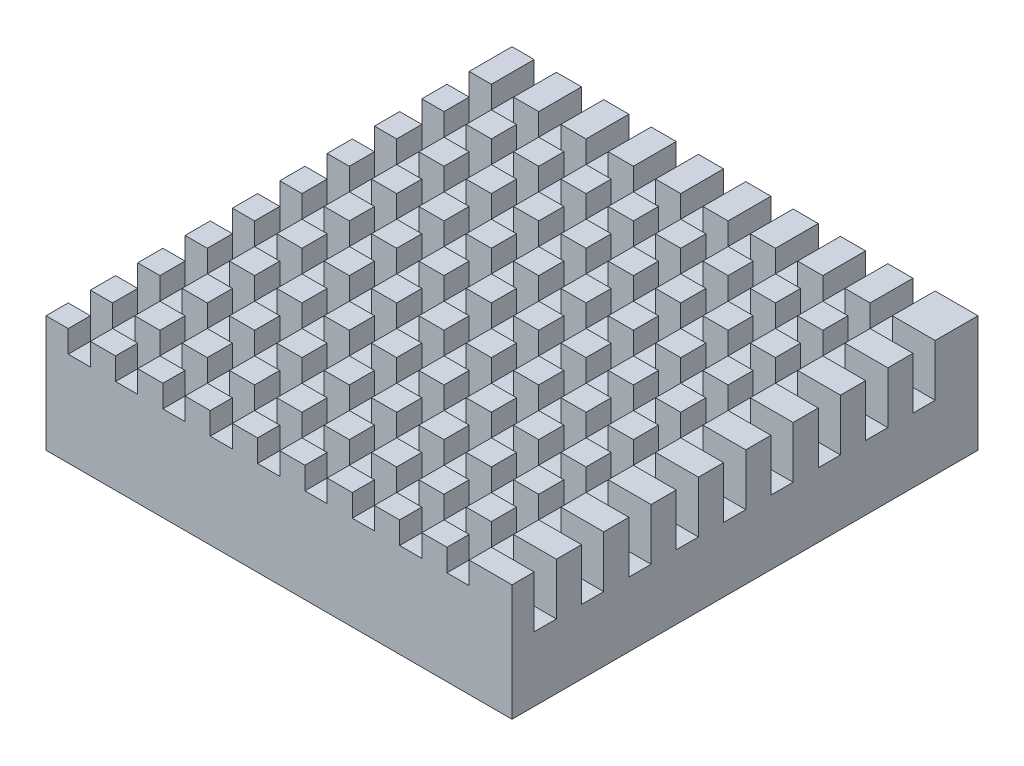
from build123d import *

# Parameters (mm, degrees)
SKETCH1_W           = 40
SKETCH1_H           = 40
BOSS_EXTRUDE1_DEPTH = 10
SKETCH2_W           = 40
SKETCH2_H           = 1.905
CUT_EXTRUDE1_DEPTH  = 4.445
LPATTERN1_COUNT     = 9
LPATTERN1_PITCH     = 4.064
SKETCH3_W           = 1.905
SKETCH3_H           = 40
CUT_EXTRUDE2_DEPTH  = 1.905
LPATTERN2_COUNT     = 9
LPATTERN2_PITCH     = 4.064


with BuildPart() as part:
    # Sketch1 → Boss-Extrude1 (new body)
    with BuildSketch(Plane(origin=(0, 0, 0), x_dir=(1, 0, 0), z_dir=(0, 1, 0))):
        Rectangle(SKETCH1_W, SKETCH1_H)
    extrude(amount=BOSS_EXTRUDE1_DEPTH)

    # Sketch2 → Cut-Extrude1 (cut)
    with BuildSketch(Plane(origin=(0, 10, 0), x_dir=(1, 0, 0), z_dir=(0, 1, 0))):
        with Locations((0, -17.1425)):
            Rectangle(SKETCH2_W, SKETCH2_H)
    cut_extrude1 = extrude(amount=-CUT_EXTRUDE1_DEPTH, mode=Mode.SUBTRACT)

    # LPattern1: Cut-Extrude1 ×9
    with Locations(*[(0, 0, -i * LPATTERN1_PITCH) for i in range(1, LPATTERN1_COUNT)]):
        add(cut_extrude1, mode=Mode.SUBTRACT)

    # Sketch3 → Cut-Extrude2 (cut)
    with BuildSketch(Plane(origin=(0, 10, 0), x_dir=(1, 0, 0), z_dir=(0, 1, 0))):
        with Locations((-17.1425, 0)):
            Rectangle(SKETCH3_W, SKETCH3_H)
    cut_extrude2 = extrude(amount=-CUT_EXTRUDE2_DEPTH, mode=Mode.SUBTRACT)

    # LPattern2: Cut-Extrude2 ×9
    with Locations(*[(i * LPATTERN2_PITCH, 0, 0) for i in range(1, LPATTERN2_COUNT)]):
        add(cut_extrude2, mode=Mode.SUBTRACT)


solid = part.part
